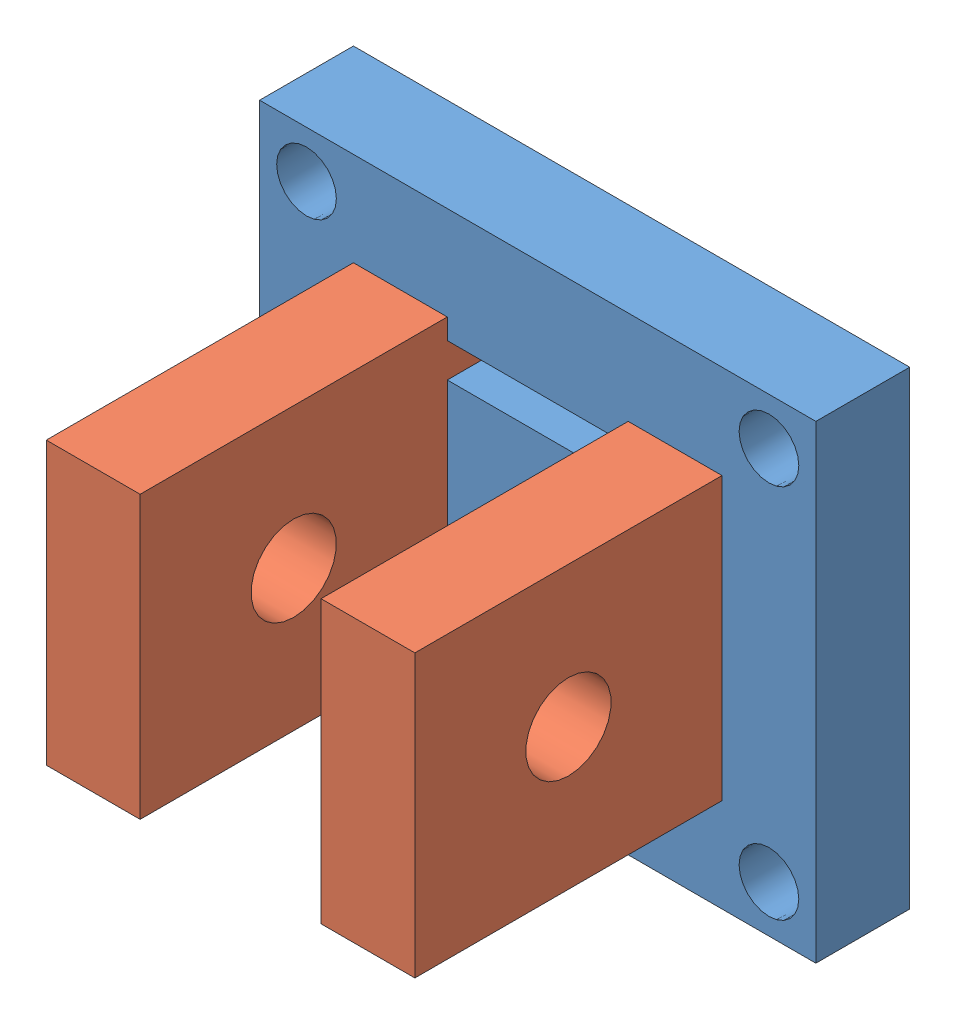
SolidWorks assembly holder5.SLDASM, configuration Default (file format 11000). Lengths in mm.
Overall size (32.6 27.5 23.5).
3 component instances, 2 part files, 7 mates.
Components (placement in the parent):
- idler_holder2-1: idler_holder2.SLDPRT [Default] at (17.6094 11.3873 25.9739) size (32.6 27.5 5.5)
- idler_holder3-1: idler_holder3.SLDPRT [Default] at (7.0094 9.1873 25.9739) x (0 -1 0) z (-1 0 0) size (16.5 23.5 5.5)
- idler_holder3-2: idler_holder3.SLDPRT [Default] at (23.1094 9.1873 25.9739) x (0 -1 0) z (-1 0 0) size (16.5 23.5 5.5)
Mates (geometry in assembly coordinates):
- Coincident1: coincident: plane of idler_holder2-1 through (17.6094 11.3873 25.9739) normal (0 0 -1); plane of idler_holder3-1 through (-17.0937 20.1873 25.9739) normal (0 0 -1)
- Coincident2: coincident: plane of idler_holder2-1 through (17.6094 11.3873 25.9739) normal (0 0 -1); plane of idler_holder3-2 through (17.6094 20.1873 25.9739) normal (0 0 -1)
- Coincident3: coincident: line of idler_holder2-1 through (17.6094 20.1873 25.9739) axis (1 0 0); line of idler_holder3-2 through (17.6094 20.1873 25.9739) axis (1 0 0)
- Coincident4: coincident: line of idler_holder2-1 through (23.1094 9.1873 25.9739) axis (0 1 0); line of idler_holder3-2 through (23.1094 14.6873 25.9739) axis (0 -1 0)
- Coincident5: coincident: line of idler_holder2-1 through (1.5094 20.1873 25.9739) axis (1 0 0); line of idler_holder3-1 through (-17.0937 20.1873 25.9739) axis (1 0 0)
- Coincident6: coincident: plane of idler_holder2-1 through (7.0094 9.1873 31.4739) normal (0 1 0); plane of idler_holder3-1 through (1.5094 9.1873 49.4739) normal (0 -1 0)
- Coincident7: coincident: plane of idler_holder2-1 through (1.5094 20.1873 31.4739) normal (1 0 0); plane of idler_holder3-1 through (1.5094 9.1873 25.9739) normal (-1 0 0)
